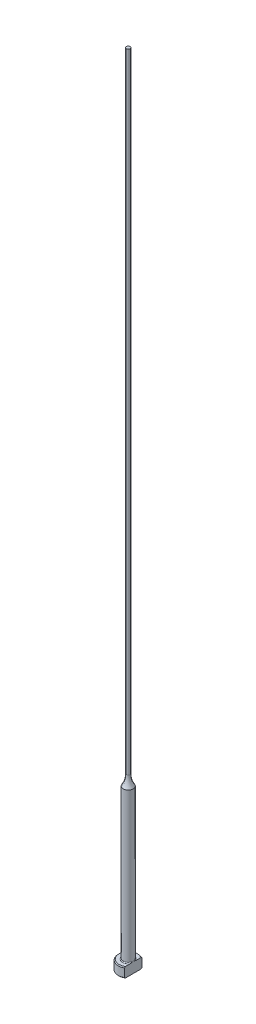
ISO-10303-21;
HEADER;
FILE_DESCRIPTION(('STEP AP214'),'2;1');
FILE_NAME('part.step','',(''),(''),'','','');
FILE_SCHEMA(('AUTOMOTIVE_DESIGN { 1 0 10303 214 1 1 1 1 }'));
ENDSEC;
DATA;
#1=APPLICATION_CONTEXT('core data for automotive mechanical design processes');
#2=APPLICATION_PROTOCOL_DEFINITION('international standard','automotive_design',2000,#1);
#3=PRODUCT_CONTEXT('',#1,'mechanical');
#4=PRODUCT('Part','Part','',(#3));
#5=PRODUCT_RELATED_PRODUCT_CATEGORY('part','',(#4));
#6=PRODUCT_DEFINITION_FORMATION('','',#4);
#7=PRODUCT_DEFINITION_CONTEXT('part definition',#1,'design');
#8=PRODUCT_DEFINITION('design','',#6,#7);
#9=PRODUCT_DEFINITION_SHAPE('','',#8);
#10=(LENGTH_UNIT() NAMED_UNIT(*) SI_UNIT(.MILLI.,.METRE.));
#11=(NAMED_UNIT(*) PLANE_ANGLE_UNIT() SI_UNIT($,.RADIAN.));
#12=(NAMED_UNIT(*) SI_UNIT($,.STERADIAN.) SOLID_ANGLE_UNIT());
#13=UNCERTAINTY_MEASURE_WITH_UNIT(LENGTH_MEASURE(1.E-05),#10,'distance_accuracy_value','');
#14=(GEOMETRIC_REPRESENTATION_CONTEXT(3) GLOBAL_UNCERTAINTY_ASSIGNED_CONTEXT((#13)) GLOBAL_UNIT_ASSIGNED_CONTEXT((#10,
#11,#12)) REPRESENTATION_CONTEXT('',''));
#15=CARTESIAN_POINT('',(0.,0.,0.));
#16=DIRECTION('',(0.,0.,1.));
#17=DIRECTION('',(1.,0.,0.));
#18=AXIS2_PLACEMENT_3D('',#15,#16,#17);
#19=CARTESIAN_POINT('',(-3.17499999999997,3.175,0.));
#20=DIRECTION('',(0.,1.,0.));
#21=DIRECTION('',(0.,0.,1.));
#22=AXIS2_PLACEMENT_3D('',#19,#20,#21);
#23=PLANE('',#22);
#24=CARTESIAN_POINT('',(0.,3.175,0.));
#25=DIRECTION('',(0.,1.,0.));
#26=DIRECTION('',(0.,0.,1.));
#27=AXIS2_PLACEMENT_3D('',#24,#25,#26);
#28=CIRCLE('',#27,2.92099999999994);
#29=CARTESIAN_POINT('',(1.58749999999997,3.175,-2.45195529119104));
#30=VERTEX_POINT('',#29);
#31=CARTESIAN_POINT('',(1.58749999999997,3.175,2.45195529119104));
#32=VERTEX_POINT('',#31);
#33=EDGE_CURVE('E105',#30,#32,#28,.T.);
#34=ORIENTED_EDGE('',*,*,#33,.T.);
#35=DIRECTION('',(0.,0.,1.));
#36=VECTOR('',#35,1.);
#37=CARTESIAN_POINT('',(1.58749999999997,3.17499999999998,2.74963065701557));
#38=LINE('',#37,#36);
#39=CARTESIAN_POINT('',(1.58749999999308,3.175,0.933255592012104));
#40=VERTEX_POINT('',#39);
#41=EDGE_CURVE('E126',#40,#32,#38,.T.);
#42=ORIENTED_EDGE('',*,*,#41,.F.);
#43=CARTESIAN_POINT('',(0.,3.175,0.));
#44=DIRECTION('',(0.,1.,0.));
#45=DIRECTION('',(0.,0.,1.));
#46=AXIS2_PLACEMENT_3D('',#43,#44,#45);
#47=CIRCLE('',#46,1.84149999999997);
#48=CARTESIAN_POINT('',(1.58749999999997,3.17500000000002,-0.933255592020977));
#49=VERTEX_POINT('',#48);
#50=EDGE_CURVE('E11',#40,#49,#47,.F.);
#51=ORIENTED_EDGE('',*,*,#50,.T.);
#52=EDGE_CURVE('E52',#30,#49,#38,.T.);
#53=ORIENTED_EDGE('',*,*,#52,.F.);
#54=EDGE_LOOP('',(#34,#42,#51,#53));
#55=FACE_BOUND('',#54,.T.);
#56=ADVANCED_FACE('F32',(#55),#23,.T.);
#57=CARTESIAN_POINT('',(0.,259.958771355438,0.));
#58=DIRECTION('',(0.,1.,0.));
#59=DIRECTION('',(0.,0.,1.));
#60=AXIS2_PLACEMENT_3D('',#57,#58,#59);
#61=CYLINDRICAL_SURFACE('',#60,3.17499999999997);
#62=CARTESIAN_POINT('',(0.,2.92100000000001,0.));
#63=DIRECTION('',(0.,1.,0.));
#64=DIRECTION('',(0.,0.,1.));
#65=AXIS2_PLACEMENT_3D('',#62,#63,#64);
#66=CIRCLE('',#65,3.17499999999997);
#67=CARTESIAN_POINT('',(1.58749999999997,2.92100000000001,2.74963065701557));
#68=VERTEX_POINT('',#67);
#69=CARTESIAN_POINT('',(1.58749999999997,2.92100000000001,-2.74963065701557));
#70=VERTEX_POINT('',#69);
#71=EDGE_CURVE('E98',#68,#70,#66,.F.);
#72=ORIENTED_EDGE('',*,*,#71,.T.);
#73=DIRECTION('',(0.,-1.,0.));
#74=VECTOR('',#73,1.);
#75=CARTESIAN_POINT('',(1.58749999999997,254.001,-2.74963065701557));
#76=LINE('',#75,#74);
#77=CARTESIAN_POINT('',(1.58749999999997,0.253999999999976,-2.74963065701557));
#78=VERTEX_POINT('',#77);
#79=EDGE_CURVE('E141',#70,#78,#76,.T.);
#80=ORIENTED_EDGE('',*,*,#79,.T.);
#81=CARTESIAN_POINT('',(0.,0.253999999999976,0.));
#82=DIRECTION('',(0.,-1.,0.));
#83=DIRECTION('',(0.,0.,-1.));
#84=AXIS2_PLACEMENT_3D('',#81,#82,#83);
#85=CIRCLE('',#84,3.17499999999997);
#86=CARTESIAN_POINT('',(1.58749999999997,0.253999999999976,2.74963065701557));
#87=VERTEX_POINT('',#86);
#88=EDGE_CURVE('E95',#78,#87,#85,.F.);
#89=ORIENTED_EDGE('',*,*,#88,.T.);
#90=DIRECTION('',(0.,-1.,0.));
#91=VECTOR('',#90,1.);
#92=CARTESIAN_POINT('',(1.58749999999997,254.001,2.74963065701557));
#93=LINE('',#92,#91);
#94=EDGE_CURVE('E88',#68,#87,#93,.T.);
#95=ORIENTED_EDGE('',*,*,#94,.F.);
#96=EDGE_LOOP('',(#72,#80,#89,#95));
#97=FACE_BOUND('',#96,.T.);
#98=ADVANCED_FACE('F191',(#97),#61,.T.);
#99=CARTESIAN_POINT('',(0.,0.,0.));
#100=DIRECTION('',(0.,-1.,0.));
#101=DIRECTION('',(0.,0.,-1.));
#102=AXIS2_PLACEMENT_3D('',#99,#100,#101);
#103=PLANE('',#102);
#104=CARTESIAN_POINT('',(0.,0.,0.));
#105=DIRECTION('',(0.,-1.,0.));
#106=DIRECTION('',(0.,0.,-1.));
#107=AXIS2_PLACEMENT_3D('',#104,#105,#106);
#108=CIRCLE('',#107,2.92100000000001);
#109=CARTESIAN_POINT('',(1.58749999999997,0.,2.45195529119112));
#110=VERTEX_POINT('',#109);
#111=CARTESIAN_POINT('',(1.58749999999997,0.,-2.45195529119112));
#112=VERTEX_POINT('',#111);
#113=EDGE_CURVE('E93',#110,#112,#108,.T.);
#114=ORIENTED_EDGE('',*,*,#113,.T.);
#115=DIRECTION('',(0.,0.,1.));
#116=VECTOR('',#115,1.);
#117=CARTESIAN_POINT('',(1.58749999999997,0.,2.74963065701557));
#118=LINE('',#117,#116);
#119=EDGE_CURVE('E78',#112,#110,#118,.T.);
#120=ORIENTED_EDGE('',*,*,#119,.T.);
#121=EDGE_LOOP('',(#114,#120));
#122=FACE_BOUND('',#121,.T.);
#123=ADVANCED_FACE('F97',(#122),#103,.T.);
#124=CARTESIAN_POINT('',(0.,3.17499999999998,0.));
#125=DIRECTION('',(0.,-1.,0.));
#126=DIRECTION('',(0.,0.,-1.));
#127=AXIS2_PLACEMENT_3D('',#124,#125,#126);
#128=CONICAL_SURFACE('',#127,2.92099999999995,0.785398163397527);
#129=ORIENTED_EDGE('',*,*,#71,.F.);
#130=CARTESIAN_POINT('',(1.58749999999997,-0.16162066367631,-6.0529050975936));
#131=CARTESIAN_POINT('',(1.58749999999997,-0.0288893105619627,-5.91567682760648));
#132=CARTESIAN_POINT('',(1.58749999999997,0.103699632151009,-5.7783103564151));
#133=CARTESIAN_POINT('',(1.58749999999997,0.368508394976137,-5.50321874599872));
#134=CARTESIAN_POINT('',(1.58749999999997,0.500728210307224,-5.36549360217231));
#135=CARTESIAN_POINT('',(1.58749999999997,0.764778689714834,-5.08953516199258));
#136=CARTESIAN_POINT('',(1.58749999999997,0.896609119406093,-4.9513016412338));
#137=CARTESIAN_POINT('',(1.58749999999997,1.15968706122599,-4.67428233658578));
#138=CARTESIAN_POINT('',(1.58749999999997,1.29093457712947,-4.53549655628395));
#139=CARTESIAN_POINT('',(1.58749999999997,1.55007705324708,-4.25997724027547));
#140=CARTESIAN_POINT('',(1.58749999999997,1.67798684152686,-4.12325766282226));
#141=CARTESIAN_POINT('',(1.58749999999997,1.9328486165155,-3.84892898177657));
#142=CARTESIAN_POINT('',(1.58749999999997,2.05980060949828,-3.71131988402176));
#143=CARTESIAN_POINT('',(1.58749999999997,2.31237508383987,-3.43493978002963));
#144=CARTESIAN_POINT('',(1.58749999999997,2.43799784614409,-3.29616903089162));
#145=CARTESIAN_POINT('',(1.58749999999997,2.68741369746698,-3.01699558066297));
#146=CARTESIAN_POINT('',(1.58749999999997,2.81120686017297,-2.8765929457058));
#147=CARTESIAN_POINT('',(1.58749999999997,3.00875865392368,-2.64816703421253));
#148=CARTESIAN_POINT('',(1.58749999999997,3.08336151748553,-2.56087478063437));
#149=CARTESIAN_POINT('',(1.58749999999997,3.2312387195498,-2.38515423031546));
#150=CARTESIAN_POINT('',(1.58749999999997,3.30451292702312,-2.29672582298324));
#151=CARTESIAN_POINT('',(1.58749999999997,3.45004422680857,-2.1174740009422));
#152=CARTESIAN_POINT('',(1.58749999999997,3.5222823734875,-2.02663514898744));
#153=CARTESIAN_POINT('',(1.58749999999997,3.66423097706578,-1.8430252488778));
#154=CARTESIAN_POINT('',(1.58749999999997,3.73394203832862,-1.75025467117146));
#155=CARTESIAN_POINT('',(1.58749999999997,3.87080633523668,-1.5606747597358));
#156=CARTESIAN_POINT('',(1.58749999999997,3.93790459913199,-1.46382547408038));
#157=CARTESIAN_POINT('',(1.58749999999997,4.06669147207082,-1.26632594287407));
#158=CARTESIAN_POINT('',(1.58749999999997,4.1283726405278,-1.16567073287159));
#159=CARTESIAN_POINT('',(1.58749999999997,4.21402252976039,-1.01165766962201));
#160=CARTESIAN_POINT('',(1.58749999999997,4.24127929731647,-0.960142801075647));
#161=CARTESIAN_POINT('',(1.58749999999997,4.2930979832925,-0.855780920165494));
#162=CARTESIAN_POINT('',(1.58749999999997,4.31765941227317,-0.802933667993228));
#163=CARTESIAN_POINT('',(1.58749999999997,4.38614656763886,-0.642461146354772));
#164=CARTESIAN_POINT('',(1.58749999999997,4.42510149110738,-0.532518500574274));
#165=CARTESIAN_POINT('',(1.58749999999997,4.46726244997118,-0.367680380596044));
#166=CARTESIAN_POINT('',(1.58749999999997,4.47844427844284,-0.314802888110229));
#167=CARTESIAN_POINT('',(1.58749999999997,4.49576654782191,-0.208209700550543));
#168=CARTESIAN_POINT('',(1.58749999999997,4.50190743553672,-0.154494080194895));
#169=CARTESIAN_POINT('',(1.58749999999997,4.50871296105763,-0.0468792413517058));
#170=CARTESIAN_POINT('',(1.58749999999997,4.5093945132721,0.00701889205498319));
#171=CARTESIAN_POINT('',(1.58749999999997,4.50527679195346,0.114606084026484));
#172=CARTESIAN_POINT('',(1.58749999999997,4.50047706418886,0.168295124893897));
#173=CARTESIAN_POINT('',(1.58749999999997,4.48579689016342,0.27448544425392));
#174=CARTESIAN_POINT('',(1.58749999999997,4.47596081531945,0.32699298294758));
#175=CARTESIAN_POINT('',(1.58749999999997,4.45181809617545,0.430974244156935));
#176=CARTESIAN_POINT('',(1.58749999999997,4.4375096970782,0.482447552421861));
#177=CARTESIAN_POINT('',(1.58749999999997,4.40502489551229,0.584460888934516));
#178=CARTESIAN_POINT('',(1.58749999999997,4.386827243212,0.634994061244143));
#179=CARTESIAN_POINT('',(1.58749999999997,4.34729308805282,0.734789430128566));
#180=CARTESIAN_POINT('',(1.58749999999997,4.3259572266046,0.784051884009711));
#181=CARTESIAN_POINT('',(1.58749999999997,4.25791922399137,0.930549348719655));
#182=CARTESIAN_POINT('',(1.58749999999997,4.20736047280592,1.0259880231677));
#183=CARTESIAN_POINT('',(1.58749999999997,4.0995545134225,1.21304313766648));
#184=CARTESIAN_POINT('',(1.58749999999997,4.04229912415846,1.30465471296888));
#185=CARTESIAN_POINT('',(1.58749999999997,3.92308746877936,1.48526211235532));
#186=CARTESIAN_POINT('',(1.58749999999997,3.86111349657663,1.57424615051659));
#187=CARTESIAN_POINT('',(1.58749999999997,3.73408621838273,1.74990003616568));
#188=CARTESIAN_POINT('',(1.58749999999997,3.66903444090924,1.83657099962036));
#189=CARTESIAN_POINT('',(1.58749999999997,3.53583371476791,2.00931764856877));
#190=CARTESIAN_POINT('',(1.58749999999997,3.46765527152,2.09537048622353));
#191=CARTESIAN_POINT('',(1.58749999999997,3.32960643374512,2.26611736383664));
#192=CARTESIAN_POINT('',(1.58749999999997,3.25973586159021,2.35081125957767));
#193=CARTESIAN_POINT('',(1.58749999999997,3.04858139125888,2.60290121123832));
#194=CARTESIAN_POINT('',(1.58749999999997,2.90542388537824,2.76872537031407));
#195=CARTESIAN_POINT('',(1.58749999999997,2.64069522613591,3.06970913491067));
#196=CARTESIAN_POINT('',(1.58749999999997,2.51959458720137,3.20528660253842));
#197=CARTESIAN_POINT('',(1.58749999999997,2.27590400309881,3.47510321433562));
#198=CARTESIAN_POINT('',(1.58749999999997,2.15331401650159,3.60934232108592));
#199=CARTESIAN_POINT('',(1.58749999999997,1.90694239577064,3.87695374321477));
#200=CARTESIAN_POINT('',(1.58749999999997,1.78315974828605,4.0103251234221));
#201=CARTESIAN_POINT('',(1.58749999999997,1.53478104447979,4.27630880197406));
#202=CARTESIAN_POINT('',(1.58749999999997,1.41018498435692,4.40892109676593));
#203=CARTESIAN_POINT('',(1.58749999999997,1.0457468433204,4.79499418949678));
#204=CARTESIAN_POINT('',(1.58749999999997,0.80507680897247,5.04767313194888));
#205=CARTESIAN_POINT('',(1.58749999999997,0.443121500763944,5.42550911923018));
#206=CARTESIAN_POINT('',(1.58749999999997,0.322378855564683,5.55118772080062));
#207=CARTESIAN_POINT('',(1.58749999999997,0.0805914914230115,5.80225207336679));
#208=CARTESIAN_POINT('',(1.58749999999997,-0.040453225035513,5.92763782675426));
#209=CARTESIAN_POINT('',(1.58749999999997,-0.161620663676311,6.0529050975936));
#210=B_SPLINE_CURVE_WITH_KNOTS('',3,(#130,#131,#132,#133,#134,#135,#136,#137,#138,#139,#140,
#141,#142,#143,#144,#145,#146,#147,#148,#149,#150,#151,#152,#153,#154,#155,#156,#157,#158,#159,
#160,#161,#162,#163,#164,#165,#166,#167,#168,#169,#170,#171,#172,#173,#174,#175,#176,#177,#178,
#179,#180,#181,#182,#183,#184,#185,#186,#187,#188,#189,#190,#191,#192,#193,#194,#195,#196,#197,
#198,#199,#200,#201,#202,#203,#204,#205,#206,#207,#208,#209),.UNSPECIFIED.,.F.,.F.,(4,2,2,2,2,2,
2,2,2,2,2,2,2,2,2,2,2,2,2,2,2,2,2,2,2,2,2,2,2,2,2,2,2,2,2,2,2,2,2,4),(0.,0.572750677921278,
1.14550874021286,1.71856057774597,2.29160869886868,2.85328006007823,3.4149477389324,
3.97649423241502,4.53801804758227,4.88249307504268,5.22700189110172,5.5751532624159,
5.92322081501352,6.27657800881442,6.63041319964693,6.80518126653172,6.9799810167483,
7.3282426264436,7.49018491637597,7.65211285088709,7.81353889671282,7.97497832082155,
8.13501929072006,8.29512313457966,8.45612518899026,8.61709438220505,8.94062993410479,
9.2645649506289,9.58978187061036,9.91483894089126,10.2441741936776,10.5735441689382,
11.2306812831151,11.7760337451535,12.3214014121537,12.8672825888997,13.4131663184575,
14.4600164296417,14.9828595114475,15.5056983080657),.UNSPECIFIED.);
#211=EDGE_CURVE('E118',#32,#68,#210,.T.);
#212=ORIENTED_EDGE('',*,*,#211,.F.);
#213=ORIENTED_EDGE('',*,*,#33,.F.);
#214=EDGE_CURVE('E117',#70,#30,#210,.T.);
#215=ORIENTED_EDGE('',*,*,#214,.F.);
#216=EDGE_LOOP('',(#129,#212,#213,#215));
#217=FACE_BOUND('',#216,.T.);
#218=ADVANCED_FACE('F162',(#217),#128,.T.);
#219=CARTESIAN_POINT('',(0.,0.253999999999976,0.));
#220=DIRECTION('',(0.,1.,0.));
#221=DIRECTION('',(0.,0.,1.));
#222=AXIS2_PLACEMENT_3D('',#219,#220,#221);
#223=CONICAL_SURFACE('',#222,3.17499999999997,0.785398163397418);
#224=ORIENTED_EDGE('',*,*,#88,.F.);
#225=CARTESIAN_POINT('',(1.58749999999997,3.33662066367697,6.0529050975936));
#226=CARTESIAN_POINT('',(1.58749999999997,3.20388931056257,5.91567682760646));
#227=CARTESIAN_POINT('',(1.58749999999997,3.07130036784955,5.77831035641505));
#228=CARTESIAN_POINT('',(1.58749999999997,2.80649160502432,5.50321874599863));
#229=CARTESIAN_POINT('',(1.58749999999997,2.67427178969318,5.3654936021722));
#230=CARTESIAN_POINT('',(1.58749999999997,2.41022131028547,5.08953516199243));
#231=CARTESIAN_POINT('',(1.58749999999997,2.27839088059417,4.95130164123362));
#232=CARTESIAN_POINT('',(1.58749999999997,2.01531293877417,4.67428233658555));
#233=CARTESIAN_POINT('',(1.58749999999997,1.88406542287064,4.5354965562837));
#234=CARTESIAN_POINT('',(1.58749999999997,1.62492294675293,4.25997724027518));
#235=CARTESIAN_POINT('',(1.58749999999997,1.49701315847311,4.12325766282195));
#236=CARTESIAN_POINT('',(1.58749999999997,1.24215138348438,3.84892898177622));
#237=CARTESIAN_POINT('',(1.58749999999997,1.11519939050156,3.71131988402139));
#238=CARTESIAN_POINT('',(1.58749999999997,0.862624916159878,3.43493978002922));
#239=CARTESIAN_POINT('',(1.58749999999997,0.737002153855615,3.29616903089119));
#240=CARTESIAN_POINT('',(1.58749999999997,0.487586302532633,3.01699558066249));
#241=CARTESIAN_POINT('',(1.58749999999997,0.363793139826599,2.8765929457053));
#242=CARTESIAN_POINT('',(1.58749999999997,0.166241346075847,2.64816703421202));
#243=CARTESIAN_POINT('',(1.58749999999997,0.0916384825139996,2.56087478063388));
#244=CARTESIAN_POINT('',(1.58749999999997,-0.0562387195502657,2.385154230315));
#245=CARTESIAN_POINT('',(1.58749999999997,-0.129512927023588,2.29672582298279));
#246=CARTESIAN_POINT('',(1.58749999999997,-0.27504422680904,2.11747400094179));
#247=CARTESIAN_POINT('',(1.58749999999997,-0.347282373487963,2.02663514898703));
#248=CARTESIAN_POINT('',(1.58749999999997,-0.489230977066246,1.84302524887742));
#249=CARTESIAN_POINT('',(1.58749999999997,-0.558942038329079,1.7502546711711));
#250=CARTESIAN_POINT('',(1.58749999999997,-0.695806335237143,1.56067475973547));
#251=CARTESIAN_POINT('',(1.58749999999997,-0.762904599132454,1.46382547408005));
#252=CARTESIAN_POINT('',(1.58749999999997,-0.891691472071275,1.26632594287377));
#253=CARTESIAN_POINT('',(1.58749999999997,-0.953372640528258,1.16567073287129));
#254=CARTESIAN_POINT('',(1.58749999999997,-1.03902252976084,1.01165766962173));
#255=CARTESIAN_POINT('',(1.58749999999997,-1.06627929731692,0.960142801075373));
#256=CARTESIAN_POINT('',(1.58749999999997,-1.11809798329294,0.85578092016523));
#257=CARTESIAN_POINT('',(1.58749999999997,-1.14265941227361,0.802933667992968));
#258=CARTESIAN_POINT('',(1.58749999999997,-1.21114656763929,0.642461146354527));
#259=CARTESIAN_POINT('',(1.58749999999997,-1.2501014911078,0.532518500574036));
#260=CARTESIAN_POINT('',(1.58749999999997,-1.29226244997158,0.367680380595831));
#261=CARTESIAN_POINT('',(1.58749999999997,-1.30344427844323,0.314802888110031));
#262=CARTESIAN_POINT('',(1.58749999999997,-1.32076654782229,0.208209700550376));
#263=CARTESIAN_POINT('',(1.58749999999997,-1.3269074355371,0.154494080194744));
#264=CARTESIAN_POINT('',(1.58749999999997,-1.333712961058,0.0468792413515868));
#265=CARTESIAN_POINT('',(1.58749999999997,-1.33439451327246,-0.00701889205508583));
#266=CARTESIAN_POINT('',(1.58749999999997,-1.33027679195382,-0.114606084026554));
#267=CARTESIAN_POINT('',(1.58749999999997,-1.32547706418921,-0.168295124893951));
#268=CARTESIAN_POINT('',(1.58749999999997,-1.31079689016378,-0.274485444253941));
#269=CARTESIAN_POINT('',(1.58749999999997,-1.3009608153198,-0.326992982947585));
#270=CARTESIAN_POINT('',(1.58749999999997,-1.27681809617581,-0.430974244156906));
#271=CARTESIAN_POINT('',(1.58749999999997,-1.26250969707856,-0.482447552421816));
#272=CARTESIAN_POINT('',(1.58749999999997,-1.23002489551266,-0.584460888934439));
#273=CARTESIAN_POINT('',(1.58749999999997,-1.21182724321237,-0.634994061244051));
#274=CARTESIAN_POINT('',(1.58749999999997,-1.1722930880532,-0.734789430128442));
#275=CARTESIAN_POINT('',(1.58749999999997,-1.15095722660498,-0.784051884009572));
#276=CARTESIAN_POINT('',(1.58749999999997,-1.08291922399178,-0.93054934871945));
#277=CARTESIAN_POINT('',(1.58749999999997,-1.03236047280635,-1.02598802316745));
#278=CARTESIAN_POINT('',(1.58749999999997,-0.924554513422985,-1.21304313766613));
#279=CARTESIAN_POINT('',(1.58749999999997,-0.86729912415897,-1.30465471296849));
#280=CARTESIAN_POINT('',(1.58749999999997,-0.748087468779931,-1.48526211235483));
#281=CARTESIAN_POINT('',(1.58749999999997,-0.686113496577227,-1.57424615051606));
#282=CARTESIAN_POINT('',(1.58749999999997,-0.55908621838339,-1.74990003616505));
#283=CARTESIAN_POINT('',(1.58749999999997,-0.494034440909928,-1.83657099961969));
#284=CARTESIAN_POINT('',(1.58749999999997,-0.360833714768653,-2.00931764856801));
#285=CARTESIAN_POINT('',(1.58749999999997,-0.292655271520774,-2.09537048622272));
#286=CARTESIAN_POINT('',(1.58749999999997,-0.154606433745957,-2.26611736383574));
#287=CARTESIAN_POINT('',(1.58749999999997,-0.0847358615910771,-2.35081125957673));
#288=CARTESIAN_POINT('',(1.58749999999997,0.126418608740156,-2.60290121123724));
#289=CARTESIAN_POINT('',(1.58749999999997,0.269576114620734,-2.76872537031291));
#290=CARTESIAN_POINT('',(1.58749999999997,0.534304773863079,-3.06970913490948));
#291=CARTESIAN_POINT('',(1.58749999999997,0.655405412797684,-3.20528660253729));
#292=CARTESIAN_POINT('',(1.58749999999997,0.899095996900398,-3.47510321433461));
#293=CARTESIAN_POINT('',(1.58749999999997,1.02168598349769,-3.60934232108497));
#294=CARTESIAN_POINT('',(1.58749999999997,1.26805760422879,-3.87695374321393));
#295=CARTESIAN_POINT('',(1.58749999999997,1.39184025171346,-4.01032512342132));
#296=CARTESIAN_POINT('',(1.58749999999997,1.64021895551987,-4.2763088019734));
#297=CARTESIAN_POINT('',(1.58749999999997,1.76481501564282,-4.40892109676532));
#298=CARTESIAN_POINT('',(1.58749999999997,2.12925315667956,-4.79499418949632));
#299=CARTESIAN_POINT('',(1.58749999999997,2.36992319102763,-5.04767313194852));
#300=CARTESIAN_POINT('',(1.58749999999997,2.73187849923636,-5.42550911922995));
#301=CARTESIAN_POINT('',(1.58749999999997,2.85262114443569,-5.55118772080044));
#302=CARTESIAN_POINT('',(1.58749999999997,3.09440850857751,-5.8022520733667));
#303=CARTESIAN_POINT('',(1.58749999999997,3.2154532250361,-5.92763782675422));
#304=CARTESIAN_POINT('',(1.58749999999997,3.33662066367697,-6.0529050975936));
#305=B_SPLINE_CURVE_WITH_KNOTS('',3,(#225,#226,#227,#228,#229,#230,#231,#232,#233,#234,#235,
#236,#237,#238,#239,#240,#241,#242,#243,#244,#245,#246,#247,#248,#249,#250,#251,#252,#253,#254,
#255,#256,#257,#258,#259,#260,#261,#262,#263,#264,#265,#266,#267,#268,#269,#270,#271,#272,#273,
#274,#275,#276,#277,#278,#279,#280,#281,#282,#283,#284,#285,#286,#287,#288,#289,#290,#291,#292,
#293,#294,#295,#296,#297,#298,#299,#300,#301,#302,#303,#304),.UNSPECIFIED.,.F.,.F.,(4,2,2,2,2,2,
2,2,2,2,2,2,2,2,2,2,2,2,2,2,2,2,2,2,2,2,2,2,2,2,2,2,2,2,2,2,2,2,2,4),(0.,0.57275067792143,
1.14550874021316,1.71856057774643,2.29160869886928,2.85328006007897,3.41494773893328,
3.97649423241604,4.53801804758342,4.88249307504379,5.2270018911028,5.57515326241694,
5.92322081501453,6.27657800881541,6.63041319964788,6.80518126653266,6.97998101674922,
7.32824262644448,7.49018491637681,7.65211285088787,7.81353889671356,7.97497832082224,
8.1350192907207,8.29512313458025,8.45612518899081,8.61709438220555,8.94062993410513,
9.26456495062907,9.58978187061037,9.91483894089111,10.2441741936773,10.5735441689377,
11.2306812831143,11.776033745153,12.3214014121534,12.8672825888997,13.4131663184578,
14.4600164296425,14.9828595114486,15.505698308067),.UNSPECIFIED.);
#306=EDGE_CURVE('E81',#112,#78,#305,.T.);
#307=ORIENTED_EDGE('',*,*,#306,.F.);
#308=ORIENTED_EDGE('',*,*,#113,.F.);
#309=EDGE_CURVE('E84',#87,#110,#305,.T.);
#310=ORIENTED_EDGE('',*,*,#309,.F.);
#311=EDGE_LOOP('',(#224,#307,#308,#310));
#312=FACE_BOUND('',#311,.T.);
#313=ADVANCED_FACE('F92',(#312),#223,.T.);
#314=CARTESIAN_POINT('',(0.,3.42900000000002,0.));
#315=DIRECTION('',(0.,1.,0.));
#316=DIRECTION('',(0.,0.,1.));
#317=AXIS2_PLACEMENT_3D('',#314,#315,#316);
#318=TOROIDAL_SURFACE('',#317,1.84149999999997,0.254);
#319=CARTESIAN_POINT('',(1.58749999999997,3.42900000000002,0.));
#320=CARTESIAN_POINT('',(1.58749999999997,3.42899942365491,-1.9220514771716E-10));
#321=CARTESIAN_POINT('',(1.58749999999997,3.42899884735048,-1.2261161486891E-07));
#322=CARTESIAN_POINT('',(1.58749999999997,3.42899773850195,-5.09676365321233E-07));
#323=CARTESIAN_POINT('',(1.58749999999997,3.42899720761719,-7.78176328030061E-07));
#324=CARTESIAN_POINT('',(1.58749999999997,3.42899614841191,-1.42307272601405E-06));
#325=CARTESIAN_POINT('',(1.58749999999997,3.42899562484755,-1.80713867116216E-06));
#326=CARTESIAN_POINT('',(1.58749999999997,3.42899463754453,-2.63494846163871E-06));
#327=CARTESIAN_POINT('',(1.58749999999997,3.42899417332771,-3.07814756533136E-06));
#328=CARTESIAN_POINT('',(1.58749999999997,3.42899261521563,-4.66897357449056E-06));
#329=CARTESIAN_POINT('',(1.58749999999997,3.42899159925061,-5.89404908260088E-06));
#330=CARTESIAN_POINT('',(1.58749999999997,3.42898979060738,-8.42427511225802E-06));
#331=CARTESIAN_POINT('',(1.58749999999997,3.42898899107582,-9.7248057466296E-06));
#332=CARTESIAN_POINT('',(1.58749999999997,3.42898598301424,-1.48060601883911E-05));
#333=CARTESIAN_POINT('',(1.58749999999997,3.42898393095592,-1.86838281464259E-05));
#334=CARTESIAN_POINT('',(1.58749999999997,3.42898057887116,-2.63261117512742E-05));
#335=CARTESIAN_POINT('',(1.58749999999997,3.42897922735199,-3.00687417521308E-05));
#336=CARTESIAN_POINT('',(1.58749999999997,3.42897347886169,-4.60276298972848E-05));
#337=CARTESIAN_POINT('',(1.58749999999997,3.42896911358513,-5.8247019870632E-05));
#338=CARTESIAN_POINT('',(1.58749999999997,3.42896211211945,-8.11070097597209E-05));
#339=CARTESIAN_POINT('',(1.58749999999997,3.42895931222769,-9.16953114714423E-05));
#340=CARTESIAN_POINT('',(1.58749999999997,3.42893712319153,-0.000168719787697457));
#341=CARTESIAN_POINT('',(1.58749999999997,3.42890881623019,-0.000232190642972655));
#342=CARTESIAN_POINT('',(1.58749999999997,3.42880276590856,-0.000479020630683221));
#343=CARTESIAN_POINT('',(1.58749999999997,3.42873165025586,-0.00066443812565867));
#344=CARTESIAN_POINT('',(1.58749999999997,3.42845137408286,-0.0013844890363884));
#345=CARTESIAN_POINT('',(1.58749999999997,3.42823526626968,-0.00191701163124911));
#346=CARTESIAN_POINT('',(1.58749999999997,3.42735449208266,-0.00409774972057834));
#347=CARTESIAN_POINT('',(1.58749999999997,3.42669768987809,-0.00574830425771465));
#348=CARTESIAN_POINT('',(1.58749999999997,3.4174405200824,-0.0289985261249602));
#349=CARTESIAN_POINT('',(1.58749999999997,3.40878325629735,-0.0505816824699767));
#350=CARTESIAN_POINT('',(1.58749999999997,3.39189297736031,-0.0929947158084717));
#351=CARTESIAN_POINT('',(1.58749999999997,3.38365605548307,-0.11382315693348));
#352=CARTESIAN_POINT('',(1.58749999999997,3.36635393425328,-0.157956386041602));
#353=CARTESIAN_POINT('',(1.58749999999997,3.35730391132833,-0.181267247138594));
#354=CARTESIAN_POINT('',(1.58749999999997,3.33936775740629,-0.228222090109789));
#355=CARTESIAN_POINT('',(1.58749999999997,3.33048420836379,-0.25186705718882));
#356=CARTESIAN_POINT('',(1.58749999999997,3.30894496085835,-0.310512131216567));
#357=CARTESIAN_POINT('',(1.58749999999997,3.29649449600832,-0.345588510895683));
#358=CARTESIAN_POINT('',(1.58749999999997,3.27296975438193,-0.415278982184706));
#359=CARTESIAN_POINT('',(1.58749999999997,3.26186987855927,-0.449884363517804));
#360=CARTESIAN_POINT('',(1.58749999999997,3.2395832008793,-0.524471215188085));
#361=CARTESIAN_POINT('',(1.58749999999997,3.22860862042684,-0.564517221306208));
#362=CARTESIAN_POINT('',(1.58749999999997,3.20902534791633,-0.645529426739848));
#363=CARTESIAN_POINT('',(1.58749999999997,3.20043582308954,-0.686500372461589));
#364=CARTESIAN_POINT('',(1.58749999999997,3.18611712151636,-0.771546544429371));
#365=CARTESIAN_POINT('',(1.58749999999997,3.18059550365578,-0.815658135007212));
#366=CARTESIAN_POINT('',(1.58749999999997,3.17455396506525,-0.904117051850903));
#367=CARTESIAN_POINT('',(1.58749999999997,3.17401361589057,-0.948462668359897));
#368=CARTESIAN_POINT('',(1.58749999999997,3.17898948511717,-1.02531896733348));
#369=CARTESIAN_POINT('',(1.58749999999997,3.1829739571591,-1.05792141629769));
#370=CARTESIAN_POINT('',(1.58749999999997,3.19569167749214,-1.12184393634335));
#371=CARTESIAN_POINT('',(1.58749999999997,3.20436049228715,-1.1531753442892));
#372=CARTESIAN_POINT('',(1.58749999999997,3.22236152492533,-1.19946468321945));
#373=CARTESIAN_POINT('',(1.58749999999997,3.2295150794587,-1.21526783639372));
#374=CARTESIAN_POINT('',(1.58749999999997,3.24587062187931,-1.24583726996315));
#375=CARTESIAN_POINT('',(1.58749999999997,3.25507530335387,-1.26060215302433));
#376=CARTESIAN_POINT('',(1.58749999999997,3.27378481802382,-1.28575815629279));
#377=CARTESIAN_POINT('',(1.58749999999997,3.28289001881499,-1.29644383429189));
#378=CARTESIAN_POINT('',(1.58749999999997,3.30268460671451,-1.31623154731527));
#379=CARTESIAN_POINT('',(1.58749999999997,3.31337067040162,-1.32533681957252));
#380=CARTESIAN_POINT('',(1.58749999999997,3.33349977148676,-1.33941140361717));
#381=CARTESIAN_POINT('',(1.58749999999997,3.34261446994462,-1.34484814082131));
#382=CARTESIAN_POINT('',(1.58749999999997,3.36161455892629,-1.35416329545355));
#383=CARTESIAN_POINT('',(1.58749999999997,3.37149946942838,-1.35804267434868));
#384=CARTESIAN_POINT('',(1.58749999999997,3.39188678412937,-1.36398436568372));
#385=CARTESIAN_POINT('',(1.58749999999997,3.40239309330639,-1.36603350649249));
#386=CARTESIAN_POINT('',(1.58749999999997,3.42360372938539,-1.3680840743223));
#387=CARTESIAN_POINT('',(1.58749999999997,3.43430795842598,-1.36808648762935));
#388=CARTESIAN_POINT('',(1.58749999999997,3.45433283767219,-1.36616208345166));
#389=CARTESIAN_POINT('',(1.58749999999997,3.46367506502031,-1.36444960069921));
#390=CARTESIAN_POINT('',(1.58749999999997,3.48195519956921,-1.35953338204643));
#391=CARTESIAN_POINT('',(1.58749999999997,3.49089304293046,-1.3563294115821));
#392=CARTESIAN_POINT('',(1.58749999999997,3.50850302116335,-1.34848006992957));
#393=CARTESIAN_POINT('',(1.58749999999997,3.5171531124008,-1.34378578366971));
#394=CARTESIAN_POINT('',(1.58749999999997,3.53371257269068,-1.33324445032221));
#395=CARTESIAN_POINT('',(1.58749999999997,3.54162163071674,-1.32739692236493));
#396=CARTESIAN_POINT('',(1.58749999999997,3.56107121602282,-1.31107304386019));
#397=CARTESIAN_POINT('',(1.58749999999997,3.57202221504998,-1.29989286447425));
#398=CARTESIAN_POINT('',(1.58749999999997,3.59202509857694,-1.27593566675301));
#399=CARTESIAN_POINT('',(1.58749999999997,3.60107086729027,-1.26315370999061));
#400=CARTESIAN_POINT('',(1.58749999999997,3.62186023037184,-1.22930733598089));
#401=CARTESIAN_POINT('',(1.58749999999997,3.63240584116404,-1.20751096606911));
#402=CARTESIAN_POINT('',(1.58749999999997,3.65004643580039,-1.16266144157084));
#403=CARTESIAN_POINT('',(1.58749999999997,3.65714435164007,-1.13960937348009));
#404=CARTESIAN_POINT('',(1.58749999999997,3.67265428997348,-1.07603916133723));
#405=CARTESIAN_POINT('',(1.58749999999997,3.67834921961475,-1.03486686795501));
#406=CARTESIAN_POINT('',(1.58749999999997,3.68382880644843,-0.951558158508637));
#407=CARTESIAN_POINT('',(1.58749999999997,3.68350976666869,-0.909417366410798));
#408=CARTESIAN_POINT('',(1.58749999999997,3.67745397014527,-0.811383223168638));
#409=CARTESIAN_POINT('',(1.58749999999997,3.66993873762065,-0.755610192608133));
#410=CARTESIAN_POINT('',(1.58749999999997,3.64933373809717,-0.644937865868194));
#411=CARTESIAN_POINT('',(1.58749999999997,3.63621897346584,-0.59004364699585));
#412=CARTESIAN_POINT('',(1.58749999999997,3.60740922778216,-0.485757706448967));
#413=CARTESIAN_POINT('',(1.58749999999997,3.59201096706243,-0.436281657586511));
#414=CARTESIAN_POINT('',(1.58749999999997,3.55922497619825,-0.338551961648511));
#415=CARTESIAN_POINT('',(1.58749999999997,3.5418584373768,-0.290291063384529));
#416=CARTESIAN_POINT('',(1.58749999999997,3.51760237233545,-0.225557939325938));
#417=CARTESIAN_POINT('',(1.58749999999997,3.51126413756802,-0.208874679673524));
#418=CARTESIAN_POINT('',(1.58749999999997,3.49830042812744,-0.17512392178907));
#419=CARTESIAN_POINT('',(1.58749999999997,3.49167176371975,-0.158057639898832));
#420=CARTESIAN_POINT('',(1.58749999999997,3.47585523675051,-0.117638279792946));
#421=CARTESIAN_POINT('',(1.58749999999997,3.46662970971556,-0.0943002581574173));
#422=CARTESIAN_POINT('',(1.58749999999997,3.44889695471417,-0.0497824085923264));
#423=CARTESIAN_POINT('',(1.58749999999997,3.44040039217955,-0.028598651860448));
#424=CARTESIAN_POINT('',(1.58749999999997,3.43130364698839,-0.00575168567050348));
#425=CARTESIAN_POINT('',(1.58749999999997,3.43064818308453,-0.00410451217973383));
#426=CARTESIAN_POINT('',(1.58749999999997,3.42976776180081,-0.00192459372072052));
#427=CARTESIAN_POINT('',(1.58749999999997,3.42955062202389,-0.00138952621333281));
#428=CARTESIAN_POINT('',(1.58749999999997,3.42926908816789,-0.000666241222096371));
#429=CARTESIAN_POINT('',(1.58749999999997,3.42919771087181,-0.000480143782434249));
#430=CARTESIAN_POINT('',(1.58749999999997,3.42909131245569,-0.000232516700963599));
#431=CARTESIAN_POINT('',(1.58749999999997,3.42906294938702,-0.000168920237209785));
#432=CARTESIAN_POINT('',(1.58749999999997,3.42904072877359,-9.17527162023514E-05));
#433=CARTESIAN_POINT('',(1.58749999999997,3.42903792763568,-8.11550293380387E-05));
#434=CARTESIAN_POINT('',(1.58749999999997,3.42903091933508,-5.82743948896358E-05));
#435=CARTESIAN_POINT('',(1.58749999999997,3.42902654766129,-4.60440001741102E-05));
#436=CARTESIAN_POINT('',(1.58749999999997,3.42902079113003,-3.00727682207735E-05));
#437=CARTESIAN_POINT('',(1.58749999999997,3.42901943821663,-2.63286807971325E-05));
#438=CARTESIAN_POINT('',(1.58749999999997,3.42901608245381,-1.86836529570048E-05));
#439=CARTESIAN_POINT('',(1.58749999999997,3.4290140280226,-1.48046517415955E-05));
#440=CARTESIAN_POINT('',(1.58749999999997,3.42901101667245,-9.72223943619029E-06));
#441=CARTESIAN_POINT('',(1.58749999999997,3.42901021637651,-8.42159649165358E-06));
#442=CARTESIAN_POINT('',(1.58749999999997,3.42900840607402,-5.89129729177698E-06));
#443=CARTESIAN_POINT('',(1.58749999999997,3.42900738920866,-4.66626867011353E-06));
#444=CARTESIAN_POINT('',(1.58749999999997,3.42900582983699,-3.07568803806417E-06));
#445=CARTESIAN_POINT('',(1.58749999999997,3.42900536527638,-2.63259565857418E-06));
#446=CARTESIAN_POINT('',(1.58749999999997,3.4290043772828,-1.80506085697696E-06));
#447=CARTESIAN_POINT('',(1.58749999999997,3.42900385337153,-1.42116387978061E-06));
#448=CARTESIAN_POINT('',(1.58749999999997,3.42900279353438,-7.76675643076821E-07));
#449=CARTESIAN_POINT('',(1.58749999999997,3.42900226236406,-5.08406487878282E-07));
#450=CARTESIAN_POINT('',(1.58749999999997,3.42900115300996,-1.21901887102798E-07));
#451=CARTESIAN_POINT('',(1.58749999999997,3.42900057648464,1.92251677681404E-10));
#452=CARTESIAN_POINT('',(1.58749999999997,3.42900000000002,0.));
#453=B_SPLINE_CURVE_WITH_KNOTS('',3,(#319,#320,#321,#322,#323,#324,#325,#326,#327,#328,#329,
#330,#331,#332,#333,#334,#335,#336,#337,#338,#339,#340,#341,#342,#343,#344,#345,#346,#347,#348,
#349,#350,#351,#352,#353,#354,#355,#356,#357,#358,#359,#360,#361,#362,#363,#364,#365,#366,#367,
#368,#369,#370,#371,#372,#373,#374,#375,#376,#377,#378,#379,#380,#381,#382,#383,#384,#385,#386,
#387,#388,#389,#390,#391,#392,#393,#394,#395,#396,#397,#398,#399,#400,#401,#402,#403,#404,#405,
#406,#407,#408,#409,#410,#411,#412,#413,#414,#415,#416,#417,#418,#419,#420,#421,#422,#423,#424,
#425,#426,#427,#428,#429,#430,#431,#432,#433,#434,#435,#436,#437,#438,#439,#440,#441,#442,#443,
#444,#445,#446,#447,#448,#449,#450,#451,#452),.UNSPECIFIED.,.T.,.F.,(4,2,2,2,2,2,2,2,2,2,2,2,2,
2,2,2,2,2,2,2,2,2,2,2,2,2,2,2,2,2,2,2,2,2,2,2,2,2,2,2,2,2,2,2,2,2,2,2,2,2,2,2,2,2,2,2,2,2,2,2,2,
2,2,2,2,2,4),(0.,1.72815458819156E-06,3.50429255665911E-06,5.44431004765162E-06,
7.3675525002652E-06,1.2119089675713E-05,1.66953775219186E-05,2.98160400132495E-05,
4.17409564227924E-05,8.0660475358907E-05,0.000113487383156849,0.000321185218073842,
0.000917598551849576,0.00264089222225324,0.00797105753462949,0.0777276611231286,
0.144923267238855,0.219939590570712,0.295714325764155,0.407362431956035,0.516367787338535,
0.640878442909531,0.766362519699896,0.899536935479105,1.03216495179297,1.13045740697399,
1.22743103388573,1.27935899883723,1.33135556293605,1.37333248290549,1.41522237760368,
1.44693946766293,1.47863694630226,1.51056074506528,1.54246916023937,1.57083210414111,
1.59919951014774,1.62861579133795,1.65804436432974,1.70472658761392,1.75155645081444,
1.82378709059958,1.89595619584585,2.01995471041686,2.1460932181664,2.31447224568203,
2.48361094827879,2.6389891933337,2.79283011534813,2.84637031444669,2.9012946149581,
2.97658236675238,3.04504771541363,3.05036697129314,3.05209849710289,3.05269709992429,
3.05290520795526,3.05293806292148,3.05297701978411,3.05298895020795,3.05300207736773,
3.05300665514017,3.0530114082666,3.05301333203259,3.05301527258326,3.05301704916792,
3.05301877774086),.UNSPECIFIED.);
#454=CARTESIAN_POINT('',(1.58749999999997,3.42900000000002,0.));
#455=VERTEX_POINT('',#454);
#456=EDGE_CURVE('E47',#455,#49,#453,.T.);
#457=ORIENTED_EDGE('',*,*,#456,.T.);
#458=ORIENTED_EDGE('',*,*,#50,.F.);
#459=CARTESIAN_POINT('',(1.58749999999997,3.42900000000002,0.));
#460=CARTESIAN_POINT('',(1.58749999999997,3.42900057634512,1.9220512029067E-10));
#461=CARTESIAN_POINT('',(1.58749999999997,3.42900115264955,1.22611614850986E-07));
#462=CARTESIAN_POINT('',(1.58749999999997,3.42900226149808,5.09676365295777E-07));
#463=CARTESIAN_POINT('',(1.58749999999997,3.42900279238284,7.78176328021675E-07));
#464=CARTESIAN_POINT('',(1.58749999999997,3.42900385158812,1.42307272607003E-06));
#465=CARTESIAN_POINT('',(1.58749999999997,3.42900437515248,1.80713867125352E-06));
#466=CARTESIAN_POINT('',(1.58749999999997,3.4290053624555,2.63494846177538E-06));
#467=CARTESIAN_POINT('',(1.58749999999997,3.42900582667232,3.0781475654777E-06));
#468=CARTESIAN_POINT('',(1.58749999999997,3.4290073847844,4.66897357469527E-06));
#469=CARTESIAN_POINT('',(1.58749999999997,3.42900840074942,5.89404908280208E-06));
#470=CARTESIAN_POINT('',(1.58749999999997,3.42901020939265,8.42427511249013E-06));
#471=CARTESIAN_POINT('',(1.58749999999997,3.42901100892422,9.72480574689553E-06));
#472=CARTESIAN_POINT('',(1.58749999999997,3.42901401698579,1.48060601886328E-05));
#473=CARTESIAN_POINT('',(1.58749999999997,3.42901606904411,1.86838281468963E-05));
#474=CARTESIAN_POINT('',(1.58749999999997,3.42901942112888,2.63261117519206E-05));
#475=CARTESIAN_POINT('',(1.58749999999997,3.42902077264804,3.00687417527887E-05));
#476=CARTESIAN_POINT('',(1.58749999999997,3.42902652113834,4.60276298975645E-05));
#477=CARTESIAN_POINT('',(1.58749999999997,3.4290308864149,5.82470198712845E-05));
#478=CARTESIAN_POINT('',(1.58749999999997,3.42903788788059,8.11070097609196E-05));
#479=CARTESIAN_POINT('',(1.58749999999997,3.42904068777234,9.16953114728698E-05));
#480=CARTESIAN_POINT('',(1.58749999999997,3.4290628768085,0.000168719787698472));
#481=CARTESIAN_POINT('',(1.58749999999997,3.42909118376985,0.000232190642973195));
#482=CARTESIAN_POINT('',(1.58749999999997,3.42919723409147,0.000479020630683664));
#483=CARTESIAN_POINT('',(1.58749999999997,3.42926834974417,0.000664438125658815));
#484=CARTESIAN_POINT('',(1.58749999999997,3.42954862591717,0.00138448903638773));
#485=CARTESIAN_POINT('',(1.58749999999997,3.42976473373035,0.00191701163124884));
#486=CARTESIAN_POINT('',(1.58749999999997,3.43064550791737,0.00409774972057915));
#487=CARTESIAN_POINT('',(1.58749999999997,3.43130231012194,0.00574830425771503));
#488=CARTESIAN_POINT('',(1.58749999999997,3.44055947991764,0.0289985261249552));
#489=CARTESIAN_POINT('',(1.58749999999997,3.44921674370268,0.0505816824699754));
#490=CARTESIAN_POINT('',(1.58749999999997,3.46610702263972,0.0929947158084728));
#491=CARTESIAN_POINT('',(1.58749999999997,3.47434394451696,0.11382315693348));
#492=CARTESIAN_POINT('',(1.58749999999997,3.49164606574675,0.157956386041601));
#493=CARTESIAN_POINT('',(1.58749999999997,3.5006960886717,0.181267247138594));
#494=CARTESIAN_POINT('',(1.58749999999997,3.51863224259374,0.228222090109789));
#495=CARTESIAN_POINT('',(1.58749999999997,3.52751579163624,0.25186705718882));
#496=CARTESIAN_POINT('',(1.58749999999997,3.54905503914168,0.310512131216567));
#497=CARTESIAN_POINT('',(1.58749999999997,3.56150550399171,0.345588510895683));
#498=CARTESIAN_POINT('',(1.58749999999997,3.5850302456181,0.415278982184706));
#499=CARTESIAN_POINT('',(1.58749999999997,3.59613012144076,0.449884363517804));
#500=CARTESIAN_POINT('',(1.58749999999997,3.61841679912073,0.524471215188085));
#501=CARTESIAN_POINT('',(1.58749999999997,3.62939137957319,0.564517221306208));
#502=CARTESIAN_POINT('',(1.58749999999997,3.6489746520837,0.645529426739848));
#503=CARTESIAN_POINT('',(1.58749999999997,3.65756417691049,0.686500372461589));
#504=CARTESIAN_POINT('',(1.58749999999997,3.67188287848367,0.771546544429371));
#505=CARTESIAN_POINT('',(1.58749999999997,3.67740449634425,0.815658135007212));
#506=CARTESIAN_POINT('',(1.58749999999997,3.68344603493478,0.904117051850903));
#507=CARTESIAN_POINT('',(1.58749999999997,3.68398638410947,0.948462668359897));
#508=CARTESIAN_POINT('',(1.58749999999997,3.67901051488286,1.02531896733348));
#509=CARTESIAN_POINT('',(1.58749999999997,3.67502604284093,1.05792141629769));
#510=CARTESIAN_POINT('',(1.58749999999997,3.66230832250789,1.12184393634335));
#511=CARTESIAN_POINT('',(1.58749999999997,3.65363950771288,1.1531753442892));
#512=CARTESIAN_POINT('',(1.58749999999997,3.6356384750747,1.19946468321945));
#513=CARTESIAN_POINT('',(1.58749999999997,3.62848492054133,1.21526783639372));
#514=CARTESIAN_POINT('',(1.58749999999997,3.61212937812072,1.24583726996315));
#515=CARTESIAN_POINT('',(1.58749999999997,3.60292469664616,1.26060215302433));
#516=CARTESIAN_POINT('',(1.58749999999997,3.58421518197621,1.28575815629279));
#517=CARTESIAN_POINT('',(1.58749999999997,3.57510998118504,1.29644383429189));
#518=CARTESIAN_POINT('',(1.58749999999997,3.55531539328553,1.31623154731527));
#519=CARTESIAN_POINT('',(1.58749999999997,3.54462932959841,1.32533681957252));
#520=CARTESIAN_POINT('',(1.58749999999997,3.52450022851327,1.33941140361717));
#521=CARTESIAN_POINT('',(1.58749999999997,3.51538553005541,1.34484814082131));
#522=CARTESIAN_POINT('',(1.58749999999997,3.49638544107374,1.35416329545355));
#523=CARTESIAN_POINT('',(1.58749999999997,3.48650053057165,1.35804267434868));
#524=CARTESIAN_POINT('',(1.58749999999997,3.46611321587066,1.36398436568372));
#525=CARTESIAN_POINT('',(1.58749999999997,3.45560690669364,1.36603350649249));
#526=CARTESIAN_POINT('',(1.58749999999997,3.43439627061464,1.3680840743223));
#527=CARTESIAN_POINT('',(1.58749999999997,3.42369204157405,1.36808648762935));
#528=CARTESIAN_POINT('',(1.58749999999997,3.40366716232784,1.36616208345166));
#529=CARTESIAN_POINT('',(1.58749999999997,3.39432493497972,1.36444960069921));
#530=CARTESIAN_POINT('',(1.58749999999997,3.37604480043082,1.35953338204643));
#531=CARTESIAN_POINT('',(1.58749999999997,3.36710695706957,1.3563294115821));
#532=CARTESIAN_POINT('',(1.58749999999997,3.34949697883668,1.34848006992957));
#533=CARTESIAN_POINT('',(1.58749999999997,3.34084688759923,1.34378578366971));
#534=CARTESIAN_POINT('',(1.58749999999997,3.32428742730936,1.33324445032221));
#535=CARTESIAN_POINT('',(1.58749999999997,3.31637836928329,1.32739692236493));
#536=CARTESIAN_POINT('',(1.58749999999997,3.29692878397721,1.31107304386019));
#537=CARTESIAN_POINT('',(1.58749999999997,3.28597778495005,1.29989286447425));
#538=CARTESIAN_POINT('',(1.58749999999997,3.26597490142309,1.27593566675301));
#539=CARTESIAN_POINT('',(1.58749999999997,3.25692913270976,1.26315370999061));
#540=CARTESIAN_POINT('',(1.58749999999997,3.23613976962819,1.22930733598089));
#541=CARTESIAN_POINT('',(1.58749999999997,3.22559415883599,1.20751096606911));
#542=CARTESIAN_POINT('',(1.58749999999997,3.20795356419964,1.16266144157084));
#543=CARTESIAN_POINT('',(1.58749999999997,3.20085564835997,1.13960937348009));
#544=CARTESIAN_POINT('',(1.58749999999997,3.18534571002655,1.07603916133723));
#545=CARTESIAN_POINT('',(1.58749999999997,3.17965078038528,1.03486686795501));
#546=CARTESIAN_POINT('',(1.58749999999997,3.1741711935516,0.951558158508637));
#547=CARTESIAN_POINT('',(1.58749999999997,3.17449023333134,0.909417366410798));
#548=CARTESIAN_POINT('',(1.58749999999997,3.18054602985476,0.811383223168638));
#549=CARTESIAN_POINT('',(1.58749999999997,3.18806126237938,0.755610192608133));
#550=CARTESIAN_POINT('',(1.58749999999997,3.20866626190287,0.644937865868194));
#551=CARTESIAN_POINT('',(1.58749999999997,3.2217810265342,0.59004364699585));
#552=CARTESIAN_POINT('',(1.58749999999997,3.25059077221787,0.485757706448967));
#553=CARTESIAN_POINT('',(1.58749999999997,3.2659890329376,0.43628165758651));
#554=CARTESIAN_POINT('',(1.58749999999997,3.29877502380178,0.338551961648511));
#555=CARTESIAN_POINT('',(1.58749999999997,3.31614156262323,0.290291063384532));
#556=CARTESIAN_POINT('',(1.58749999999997,3.34039762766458,0.225557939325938));
#557=CARTESIAN_POINT('',(1.58749999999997,3.346735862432,0.208874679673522));
#558=CARTESIAN_POINT('',(1.58749999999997,3.35969957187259,0.175123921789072));
#559=CARTESIAN_POINT('',(1.58749999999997,3.3663282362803,0.15805763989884));
#560=CARTESIAN_POINT('',(1.58749999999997,3.3821447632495,0.117638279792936));
#561=CARTESIAN_POINT('',(1.58749999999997,3.39137029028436,0.0943002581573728));
#562=CARTESIAN_POINT('',(1.58749999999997,3.40910304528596,0.0497824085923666));
#563=CARTESIAN_POINT('',(1.58749999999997,3.41759960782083,0.0285986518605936));
#564=CARTESIAN_POINT('',(1.58749999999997,3.42669635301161,0.00575168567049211));
#565=CARTESIAN_POINT('',(1.58749999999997,3.42735181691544,0.00410451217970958));
#566=CARTESIAN_POINT('',(1.58749999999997,3.42823223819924,0.00192459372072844));
#567=CARTESIAN_POINT('',(1.58749999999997,3.42844937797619,0.00138952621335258));
#568=CARTESIAN_POINT('',(1.58749999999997,3.42873091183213,0.000666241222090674));
#569=CARTESIAN_POINT('',(1.58749999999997,3.42880228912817,0.000480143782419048));
#570=CARTESIAN_POINT('',(1.58749999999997,3.42890868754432,0.000232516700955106));
#571=CARTESIAN_POINT('',(1.58749999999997,3.42893705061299,0.000168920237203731));
#572=CARTESIAN_POINT('',(1.58749999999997,3.42895927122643,9.17527161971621E-05));
#573=CARTESIAN_POINT('',(1.58749999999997,3.42896207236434,8.1155029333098E-05));
#574=CARTESIAN_POINT('',(1.58749999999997,3.42896908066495,5.82743948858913E-05));
#575=CARTESIAN_POINT('',(1.58749999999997,3.42897345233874,4.60440001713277E-05));
#576=CARTESIAN_POINT('',(1.58749999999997,3.42897920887,3.00727682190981E-05));
#577=CARTESIAN_POINT('',(1.58749999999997,3.42898056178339,2.63286807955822E-05));
#578=CARTESIAN_POINT('',(1.58749999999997,3.42898391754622,1.86836529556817E-05));
#579=CARTESIAN_POINT('',(1.58749999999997,3.42898597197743,1.48046517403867E-05));
#580=CARTESIAN_POINT('',(1.58749999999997,3.42898898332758,9.72223943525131E-06));
#581=CARTESIAN_POINT('',(1.58749999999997,3.42898978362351,8.42159649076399E-06));
#582=CARTESIAN_POINT('',(1.58749999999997,3.42899159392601,5.89129729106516E-06));
#583=CARTESIAN_POINT('',(1.58749999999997,3.42899261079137,4.66626866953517E-06));
#584=CARTESIAN_POINT('',(1.58749999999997,3.42899417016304,3.0756880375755E-06));
#585=CARTESIAN_POINT('',(1.58749999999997,3.42899463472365,2.63259565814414E-06));
#586=CARTESIAN_POINT('',(1.58749999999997,3.42899562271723,1.80506085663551E-06));
#587=CARTESIAN_POINT('',(1.58749999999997,3.42899614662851,1.42116387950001E-06));
#588=CARTESIAN_POINT('',(1.58749999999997,3.42899720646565,7.7667564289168E-07));
#589=CARTESIAN_POINT('',(1.58749999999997,3.42899773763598,5.0840648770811E-07));
#590=CARTESIAN_POINT('',(1.58749999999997,3.42899884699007,1.21901887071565E-07));
#591=CARTESIAN_POINT('',(1.58749999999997,3.42899942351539,-1.92251650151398E-10));
#592=CARTESIAN_POINT('',(1.58749999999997,3.42900000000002,0.));
#593=B_SPLINE_CURVE_WITH_KNOTS('',3,(#459,#460,#461,#462,#463,#464,#465,#466,#467,#468,#469,
#470,#471,#472,#473,#474,#475,#476,#477,#478,#479,#480,#481,#482,#483,#484,#485,#486,#487,#488,
#489,#490,#491,#492,#493,#494,#495,#496,#497,#498,#499,#500,#501,#502,#503,#504,#505,#506,#507,
#508,#509,#510,#511,#512,#513,#514,#515,#516,#517,#518,#519,#520,#521,#522,#523,#524,#525,#526,
#527,#528,#529,#530,#531,#532,#533,#534,#535,#536,#537,#538,#539,#540,#541,#542,#543,#544,#545,
#546,#547,#548,#549,#550,#551,#552,#553,#554,#555,#556,#557,#558,#559,#560,#561,#562,#563,#564,
#565,#566,#567,#568,#569,#570,#571,#572,#573,#574,#575,#576,#577,#578,#579,#580,#581,#582,#583,
#584,#585,#586,#587,#588,#589,#590,#591,#592),.UNSPECIFIED.,.T.,.F.,(4,2,2,2,2,2,2,2,2,2,2,2,2,
2,2,2,2,2,2,2,2,2,2,2,2,2,2,2,2,2,2,2,2,2,2,2,2,2,2,2,2,2,2,2,2,2,2,2,2,2,2,2,2,2,2,2,2,2,2,2,2,
2,2,2,2,2,4),(0.,1.72815458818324E-06,3.50429255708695E-06,5.44431004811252E-06,
7.36755250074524E-06,1.21190896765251E-05,1.66953775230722E-05,2.98160400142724E-05,
4.17409564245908E-05,8.06604753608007E-05,0.000113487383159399,0.000321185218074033,
0.000917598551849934,0.00264089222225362,0.00797105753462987,0.077727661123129,
0.144923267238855,0.219939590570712,0.295714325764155,0.407362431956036,0.516367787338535,
0.640878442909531,0.766362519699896,0.899536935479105,1.03216495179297,1.13045740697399,
1.22743103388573,1.27935899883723,1.33135556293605,1.37333248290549,1.41522237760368,
1.44693946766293,1.47863694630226,1.51056074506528,1.54246916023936,1.57083210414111,
1.59919951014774,1.62861579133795,1.65804436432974,1.70472658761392,1.75155645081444,
1.82378709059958,1.89595619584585,2.01995471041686,2.1460932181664,2.31447224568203,
2.48361094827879,2.6389891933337,2.79283011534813,2.84637031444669,2.9012946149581,
2.97658236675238,3.04504771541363,3.05036697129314,3.05209849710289,3.05269709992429,
3.05290520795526,3.05293806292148,3.05297701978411,3.05298895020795,3.05300207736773,
3.05300665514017,3.0530114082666,3.05301333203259,3.05301527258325,3.05301704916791,
3.05301877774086),.UNSPECIFIED.);
#594=EDGE_CURVE('E147',#40,#455,#593,.T.);
#595=ORIENTED_EDGE('',*,*,#594,.T.);
#596=CARTESIAN_POINT('',(0.,3.42900000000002,0.));
#597=DIRECTION('',(0.,1.,0.));
#598=DIRECTION('',(0.,0.,1.));
#599=AXIS2_PLACEMENT_3D('',#596,#597,#598);
#600=CIRCLE('',#599,1.58749999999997);
#601=EDGE_CURVE('E40',#455,#455,#600,.T.);
#602=ORIENTED_EDGE('',*,*,#601,.F.);
#603=EDGE_LOOP('',(#457,#458,#595,#602));
#604=FACE_BOUND('',#603,.T.);
#605=ADVANCED_FACE('F34',(#604),#318,.F.);
#606=CARTESIAN_POINT('',(-0.594359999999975,254.,0.));
#607=DIRECTION('',(0.,1.,0.));
#608=DIRECTION('',(0.,0.,1.));
#609=AXIS2_PLACEMENT_3D('',#606,#607,#608);
#610=PLANE('',#609);
#611=CARTESIAN_POINT('',(0.,254.,0.));
#612=DIRECTION('',(0.,1.,0.));
#613=DIRECTION('',(0.,0.,1.));
#614=AXIS2_PLACEMENT_3D('',#611,#612,#613);
#615=CIRCLE('',#614,0.594359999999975);
#616=CARTESIAN_POINT('',(0.,254.,0.594359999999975));
#617=VERTEX_POINT('',#616);
#618=EDGE_CURVE('E108',#617,#617,#615,.T.);
#619=ORIENTED_EDGE('',*,*,#618,.T.);
#620=EDGE_LOOP('',(#619));
#621=FACE_BOUND('',#620,.T.);
#622=ADVANCED_FACE('F180',(#621),#610,.T.);
#623=CARTESIAN_POINT('',(0.,259.958771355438,0.));
#624=DIRECTION('',(0.,1.,0.));
#625=DIRECTION('',(0.,0.,1.));
#626=AXIS2_PLACEMENT_3D('',#623,#624,#625);
#627=CYLINDRICAL_SURFACE('',#626,0.594359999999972);
#628=CARTESIAN_POINT('',(0.,54.2097728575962,0.));
#629=DIRECTION('',(0.,1.,0.));
#630=DIRECTION('',(0.,0.,1.));
#631=AXIS2_PLACEMENT_3D('',#628,#629,#630);
#632=CIRCLE('',#631,0.59435999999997);
#633=CARTESIAN_POINT('',(0.,54.2097728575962,0.59435999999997));
#634=VERTEX_POINT('',#633);
#635=EDGE_CURVE('E111',#634,#634,#632,.T.);
#636=ORIENTED_EDGE('',*,*,#635,.T.);
#637=EDGE_LOOP('',(#636));
#638=FACE_BOUND('',#637,.T.);
#639=ORIENTED_EDGE('',*,*,#618,.F.);
#640=EDGE_LOOP('',(#639));
#641=FACE_BOUND('',#640,.T.);
#642=ADVANCED_FACE('F174',(#638,#641),#627,.T.);
#643=CARTESIAN_POINT('',(0.,54.2097728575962,0.));
#644=DIRECTION('',(0.,1.,0.));
#645=DIRECTION('',(0.,0.,1.));
#646=AXIS2_PLACEMENT_3D('',#643,#644,#645);
#647=TOROIDAL_SURFACE('',#646,6.94435999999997,6.35);
#648=CARTESIAN_POINT('',(0.,50.8,0.));
#649=DIRECTION('',(0.,1.,0.));
#650=DIRECTION('',(0.,0.,1.));
#651=AXIS2_PLACEMENT_3D('',#648,#649,#650);
#652=CIRCLE('',#651,1.58749999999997);
#653=CARTESIAN_POINT('',(0.,50.8,1.58749999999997));
#654=VERTEX_POINT('',#653);
#655=EDGE_CURVE('E114',#654,#654,#652,.T.);
#656=ORIENTED_EDGE('',*,*,#655,.T.);
#657=EDGE_LOOP('',(#656));
#658=FACE_BOUND('',#657,.T.);
#659=ORIENTED_EDGE('',*,*,#635,.F.);
#660=EDGE_LOOP('',(#659));
#661=FACE_BOUND('',#660,.T.);
#662=ADVANCED_FACE('F168',(#658,#661),#647,.F.);
#663=CARTESIAN_POINT('',(0.,259.958771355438,0.));
#664=DIRECTION('',(0.,1.,0.));
#665=DIRECTION('',(0.,0.,1.));
#666=AXIS2_PLACEMENT_3D('',#663,#664,#665);
#667=CYLINDRICAL_SURFACE('',#666,1.58749999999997);
#668=ORIENTED_EDGE('',*,*,#601,.T.);
#669=EDGE_LOOP('',(#668));
#670=FACE_BOUND('',#669,.T.);
#671=ORIENTED_EDGE('',*,*,#655,.F.);
#672=EDGE_LOOP('',(#671));
#673=FACE_BOUND('',#672,.T.);
#674=ADVANCED_FACE('F165',(#670,#673),#667,.T.);
#675=CARTESIAN_POINT('',(1.58749999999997,254.001,2.74963065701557));
#676=DIRECTION('',(1.,0.,0.));
#677=DIRECTION('',(0.,0.,-1.));
#678=AXIS2_PLACEMENT_3D('',#675,#676,#677);
#679=PLANE('',#678);
#680=ORIENTED_EDGE('',*,*,#309,.T.);
#681=ORIENTED_EDGE('',*,*,#119,.F.);
#682=ORIENTED_EDGE('',*,*,#306,.T.);
#683=ORIENTED_EDGE('',*,*,#79,.F.);
#684=ORIENTED_EDGE('',*,*,#214,.T.);
#685=ORIENTED_EDGE('',*,*,#52,.T.);
#686=ORIENTED_EDGE('',*,*,#456,.F.);
#687=ORIENTED_EDGE('',*,*,#594,.F.);
#688=ORIENTED_EDGE('',*,*,#41,.T.);
#689=ORIENTED_EDGE('',*,*,#211,.T.);
#690=ORIENTED_EDGE('',*,*,#94,.T.);
#691=EDGE_LOOP('',(#680,#681,#682,#683,#684,#685,#686,#687,#688,#689,#690));
#692=FACE_BOUND('',#691,.T.);
#693=ADVANCED_FACE('F80',(#692),#679,.T.);
#694=CLOSED_SHELL('',(#56,#98,#123,#218,#313,#605,#622,#642,#662,#674,#693));
#695=MANIFOLD_SOLID_BREP('B2',#694);
#696=ADVANCED_BREP_SHAPE_REPRESENTATION('',(#18,#695),#14);
#697=SHAPE_DEFINITION_REPRESENTATION(#9,#696);
ENDSEC;
END-ISO-10303-21;
